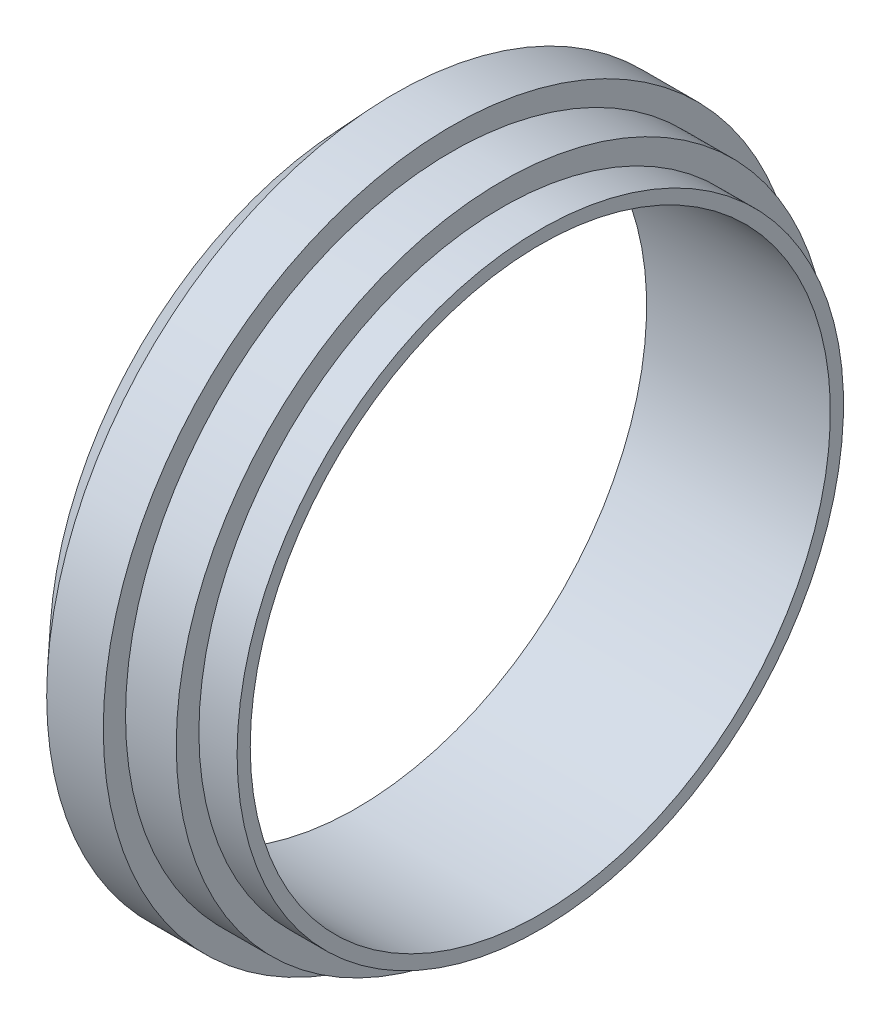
from build123d import *

# Parameters (mm, degrees)
SKETCH4_R          = 36.449
CUT_EXTRUDE1_DEPTH = 96.622985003


with BuildPart() as part:
    # Sketch1 → Revolve1 (revolve)
    with BuildSketch(Plane.XY, mode=Mode.PRIVATE) as revolve1_sk:
        Polygon((0, 0), (-4.8006, 0), (-4.8006, -2.8448), (-11.176, -2.8448), (-11.176, -5.6388), (-18.288, -5.6388), (-23.0886, -0.4826), (-23.0886, 38.1), (0, 38.1), align=None)
    revolve(revolve1_sk.sketch.rotate(Axis((-23.0886, 38.1, 0), (1, 0, 0)), 270), axis=Axis((-23.0886, 38.1, 0), (1, 0, 0)))

    # Sketch4 → Cut-Extrude1 (cut, through all)
    with BuildSketch(Plane.ZY.offset(23.0886)):
        with Locations((0, 38.1)):
            Circle(SKETCH4_R)
    extrude(amount=-CUT_EXTRUDE1_DEPTH, mode=Mode.SUBTRACT)


solid = part.part
